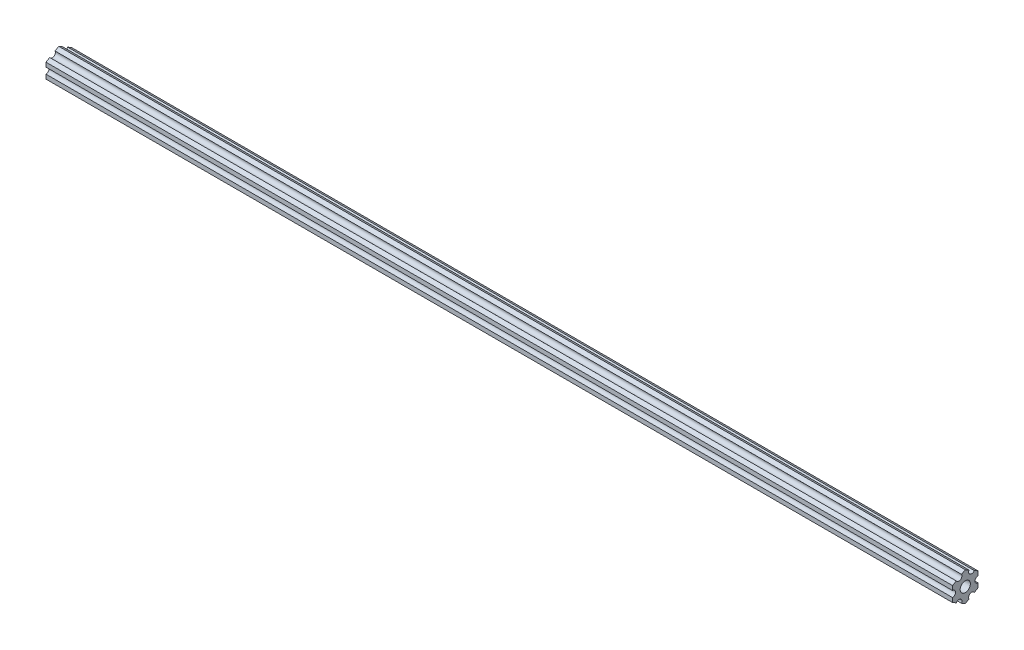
ISO-10303-21;
HEADER;
FILE_DESCRIPTION(('STEP AP214'),'2;1');
FILE_NAME('part.step','',(''),(''),'','','');
FILE_SCHEMA(('AUTOMOTIVE_DESIGN { 1 0 10303 214 1 1 1 1 }'));
ENDSEC;
DATA;
#1=APPLICATION_CONTEXT('core data for automotive mechanical design processes');
#2=APPLICATION_PROTOCOL_DEFINITION('international standard','automotive_design',2000,#1);
#3=PRODUCT_CONTEXT('',#1,'mechanical');
#4=PRODUCT('Part','Part','',(#3));
#5=PRODUCT_RELATED_PRODUCT_CATEGORY('part','',(#4));
#6=PRODUCT_DEFINITION_FORMATION('','',#4);
#7=PRODUCT_DEFINITION_CONTEXT('part definition',#1,'design');
#8=PRODUCT_DEFINITION('design','',#6,#7);
#9=PRODUCT_DEFINITION_SHAPE('','',#8);
#10=(LENGTH_UNIT() NAMED_UNIT(*) SI_UNIT(.MILLI.,.METRE.));
#11=(NAMED_UNIT(*) PLANE_ANGLE_UNIT() SI_UNIT($,.RADIAN.));
#12=(NAMED_UNIT(*) SI_UNIT($,.STERADIAN.) SOLID_ANGLE_UNIT());
#13=UNCERTAINTY_MEASURE_WITH_UNIT(LENGTH_MEASURE(1.E-05),#10,'distance_accuracy_value','');
#14=(GEOMETRIC_REPRESENTATION_CONTEXT(3) GLOBAL_UNCERTAINTY_ASSIGNED_CONTEXT((#13)) GLOBAL_UNIT_ASSIGNED_CONTEXT((#10,
#11,#12)) REPRESENTATION_CONTEXT('',''));
#15=CARTESIAN_POINT('',(0.,0.,0.));
#16=DIRECTION('',(0.,0.,1.));
#17=DIRECTION('',(1.,0.,0.));
#18=AXIS2_PLACEMENT_3D('',#15,#16,#17);
#19=CARTESIAN_POINT('',(226.06,-295.017910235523,341.513374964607));
#20=DIRECTION('',(-1.,0.,0.));
#21=DIRECTION('',(0.,0.,1.));
#22=AXIS2_PLACEMENT_3D('',#19,#20,#21);
#23=PLANE('',#22);
#24=DIRECTION('',(0.,-1.,0.));
#25=VECTOR('',#24,1.);
#26=CARTESIAN_POINT('',(226.06,-295.017910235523,335.162827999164));
#27=LINE('',#26,#25);
#28=CARTESIAN_POINT('',(226.06,-296.541910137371,335.162827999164));
#29=VERTEX_POINT('',#28);
#30=CARTESIAN_POINT('',(226.06,-298.684400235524,335.162827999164));
#31=VERTEX_POINT('',#30);
#32=EDGE_CURVE('E215',#29,#31,#27,.T.);
#33=ORIENTED_EDGE('',*,*,#32,.F.);
#34=CARTESIAN_POINT('',(226.06,-295.017910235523,335.163374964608));
#35=DIRECTION('',(-1.,0.,0.));
#36=DIRECTION('',(0.,-1.,0.));
#37=AXIS2_PLACEMENT_3D('',#34,#35,#36);
#38=CIRCLE('',#37,1.524);
#39=CARTESIAN_POINT('',(226.06,-293.493910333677,335.162827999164));
#40=VERTEX_POINT('',#39);
#41=EDGE_CURVE('E252',#29,#40,#38,.T.);
#42=ORIENTED_EDGE('',*,*,#41,.T.);
#43=DIRECTION('',(0.,-1.,0.));
#44=VECTOR('',#43,1.);
#45=CARTESIAN_POINT('',(226.06,-295.017910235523,335.162827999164));
#46=LINE('',#45,#44);
#47=CARTESIAN_POINT('',(226.06,-291.351420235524,335.162827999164));
#48=VERTEX_POINT('',#47);
#49=EDGE_CURVE('E307',#48,#40,#46,.T.);
#50=ORIENTED_EDGE('',*,*,#49,.F.);
#51=DIRECTION('',(0.,-0.5,-0.866025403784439));
#52=VECTOR('',#51,1.);
#53=CARTESIAN_POINT('',(226.06,-289.518175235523,338.338101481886));
#54=LINE('',#53,#52);
#55=CARTESIAN_POINT('',(226.06,-290.280175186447,337.018278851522));
#56=VERTEX_POINT('',#55);
#57=EDGE_CURVE('E200',#56,#48,#54,.T.);
#58=ORIENTED_EDGE('',*,*,#57,.F.);
#59=CARTESIAN_POINT('',(226.06,-289.518648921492,338.338374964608));
#60=DIRECTION('',(-1.,0.,0.));
#61=DIRECTION('',(0.,-1.,0.));
#62=AXIS2_PLACEMENT_3D('',#59,#60,#61);
#63=CIRCLE('',#62,1.524);
#64=CARTESIAN_POINT('',(226.06,-288.7561752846,339.65792411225));
#65=VERTEX_POINT('',#64);
#66=EDGE_CURVE('E203',#56,#65,#63,.T.);
#67=ORIENTED_EDGE('',*,*,#66,.T.);
#68=DIRECTION('',(0.,-0.5,-0.866025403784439));
#69=VECTOR('',#68,1.);
#70=CARTESIAN_POINT('',(226.06,-289.518175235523,338.338101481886));
#71=LINE('',#70,#69);
#72=CARTESIAN_POINT('',(226.06,-287.684930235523,341.513374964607));
#73=VERTEX_POINT('',#72);
#74=EDGE_CURVE('E321',#73,#65,#71,.T.);
#75=ORIENTED_EDGE('',*,*,#74,.F.);
#76=DIRECTION('',(0.,0.5,-0.866025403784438));
#77=VECTOR('',#76,1.);
#78=CARTESIAN_POINT('',(226.06,-289.518175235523,344.688648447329));
#79=LINE('',#78,#77);
#80=CARTESIAN_POINT('',(226.06,-288.7561752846,343.368825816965));
#81=VERTEX_POINT('',#80);
#82=EDGE_CURVE('E338',#81,#73,#79,.T.);
#83=ORIENTED_EDGE('',*,*,#82,.F.);
#84=CARTESIAN_POINT('',(226.06,-289.518648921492,344.688374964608));
#85=DIRECTION('',(-1.,0.,0.));
#86=DIRECTION('',(0.,-1.,0.));
#87=AXIS2_PLACEMENT_3D('',#84,#85,#86);
#88=CIRCLE('',#87,1.524);
#89=CARTESIAN_POINT('',(226.06,-290.280175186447,346.008471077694));
#90=VERTEX_POINT('',#89);
#91=EDGE_CURVE('E11',#81,#90,#88,.T.);
#92=ORIENTED_EDGE('',*,*,#91,.T.);
#93=DIRECTION('',(0.,0.5,-0.866025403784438));
#94=VECTOR('',#93,1.);
#95=CARTESIAN_POINT('',(226.06,-289.518175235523,344.688648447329));
#96=LINE('',#95,#94);
#97=CARTESIAN_POINT('',(226.06,-291.351420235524,347.863921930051));
#98=VERTEX_POINT('',#97);
#99=EDGE_CURVE('E360',#98,#90,#96,.T.);
#100=ORIENTED_EDGE('',*,*,#99,.F.);
#101=DIRECTION('',(0.,1.,0.));
#102=VECTOR('',#101,1.);
#103=CARTESIAN_POINT('',(226.06,-295.017910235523,347.863921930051));
#104=LINE('',#103,#102);
#105=CARTESIAN_POINT('',(226.06,-293.493910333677,347.863921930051));
#106=VERTEX_POINT('',#105);
#107=EDGE_CURVE('E219',#106,#98,#104,.T.);
#108=ORIENTED_EDGE('',*,*,#107,.F.);
#109=CARTESIAN_POINT('',(226.06,-295.017910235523,347.863374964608));
#110=DIRECTION('',(-1.,0.,0.));
#111=DIRECTION('',(0.,-1.,0.));
#112=AXIS2_PLACEMENT_3D('',#109,#110,#111);
#113=CIRCLE('',#112,1.524);
#114=CARTESIAN_POINT('',(226.06,-296.541910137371,347.863921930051));
#115=VERTEX_POINT('',#114);
#116=EDGE_CURVE('E26',#106,#115,#113,.T.);
#117=ORIENTED_EDGE('',*,*,#116,.T.);
#118=DIRECTION('',(0.,1.,0.));
#119=VECTOR('',#118,1.);
#120=CARTESIAN_POINT('',(226.06,-295.017910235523,347.863921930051));
#121=LINE('',#120,#119);
#122=CARTESIAN_POINT('',(226.06,-298.684400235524,347.863921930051));
#123=VERTEX_POINT('',#122);
#124=EDGE_CURVE('E276',#123,#115,#121,.T.);
#125=ORIENTED_EDGE('',*,*,#124,.F.);
#126=DIRECTION('',(0.,0.5,0.866025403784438));
#127=VECTOR('',#126,1.);
#128=CARTESIAN_POINT('',(226.06,-300.517645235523,344.688648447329));
#129=LINE('',#128,#127);
#130=CARTESIAN_POINT('',(226.06,-299.7556452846,346.008471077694));
#131=VERTEX_POINT('',#130);
#132=EDGE_CURVE('E221',#131,#123,#129,.T.);
#133=ORIENTED_EDGE('',*,*,#132,.F.);
#134=CARTESIAN_POINT('',(226.06,-300.517171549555,344.688374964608));
#135=DIRECTION('',(-1.,0.,0.));
#136=DIRECTION('',(0.,-1.,0.));
#137=AXIS2_PLACEMENT_3D('',#134,#135,#136);
#138=CIRCLE('',#137,1.524);
#139=CARTESIAN_POINT('',(226.06,-301.279645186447,343.368825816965));
#140=VERTEX_POINT('',#139);
#141=EDGE_CURVE('E257',#131,#140,#138,.T.);
#142=ORIENTED_EDGE('',*,*,#141,.T.);
#143=DIRECTION('',(0.,0.5,0.866025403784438));
#144=VECTOR('',#143,1.);
#145=CARTESIAN_POINT('',(226.06,-300.517645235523,344.688648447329));
#146=LINE('',#145,#144);
#147=CARTESIAN_POINT('',(226.06,-302.350890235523,341.513374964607));
#148=VERTEX_POINT('',#147);
#149=EDGE_CURVE('E287',#148,#140,#146,.T.);
#150=ORIENTED_EDGE('',*,*,#149,.F.);
#151=DIRECTION('',(0.,-0.5,0.866025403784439));
#152=VECTOR('',#151,1.);
#153=CARTESIAN_POINT('',(226.06,-300.517645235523,338.338101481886));
#154=LINE('',#153,#152);
#155=CARTESIAN_POINT('',(226.06,-301.279645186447,339.65792411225));
#156=VERTEX_POINT('',#155);
#157=EDGE_CURVE('E225',#156,#148,#154,.T.);
#158=ORIENTED_EDGE('',*,*,#157,.F.);
#159=CARTESIAN_POINT('',(226.06,-300.517171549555,338.338374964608));
#160=DIRECTION('',(-1.,0.,0.));
#161=DIRECTION('',(0.,-1.,0.));
#162=AXIS2_PLACEMENT_3D('',#159,#160,#161);
#163=CIRCLE('',#162,1.524);
#164=CARTESIAN_POINT('',(226.06,-299.7556452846,337.018278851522));
#165=VERTEX_POINT('',#164);
#166=EDGE_CURVE('E255',#156,#165,#163,.T.);
#167=ORIENTED_EDGE('',*,*,#166,.T.);
#168=DIRECTION('',(0.,-0.5,0.866025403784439));
#169=VECTOR('',#168,1.);
#170=CARTESIAN_POINT('',(226.06,-300.517645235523,338.338101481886));
#171=LINE('',#170,#169);
#172=EDGE_CURVE('E293',#31,#165,#171,.T.);
#173=ORIENTED_EDGE('',*,*,#172,.F.);
#174=EDGE_LOOP('',(#33,#42,#50,#58,#67,#75,#83,#92,#100,#108,#117,#125,#133,#142,#150,#158,#167,#173));
#175=FACE_BOUND('',#174,.T.);
#176=CARTESIAN_POINT('',(226.06,-295.017910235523,341.513374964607));
#177=DIRECTION('',(-1.,0.,0.));
#178=DIRECTION('',(0.,-1.,0.));
#179=AXIS2_PLACEMENT_3D('',#176,#177,#178);
#180=CIRCLE('',#179,2.5527);
#181=CARTESIAN_POINT('',(226.059999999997,-297.570610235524,341.513374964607));
#182=VERTEX_POINT('',#181);
#183=EDGE_CURVE('E36',#182,#182,#180,.T.);
#184=ORIENTED_EDGE('',*,*,#183,.T.);
#185=EDGE_LOOP('',(#184));
#186=FACE_BOUND('',#185,.T.);
#187=ADVANCED_FACE('F17',(#175,#186),#23,.F.);
#188=CARTESIAN_POINT('',(-226.060000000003,-289.518648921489,344.688374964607));
#189=DIRECTION('',(1.,0.,0.));
#190=DIRECTION('',(0.,1.,0.));
#191=AXIS2_PLACEMENT_3D('',#188,#189,#190);
#192=CYLINDRICAL_SURFACE('',#191,1.524);
#193=DIRECTION('',(1.,0.,0.));
#194=VECTOR('',#193,1.);
#195=CARTESIAN_POINT('',(-226.060000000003,-290.280175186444,346.008471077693));
#196=LINE('',#195,#194);
#197=CARTESIAN_POINT('',(-226.060000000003,-290.280175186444,346.008471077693));
#198=VERTEX_POINT('',#197);
#199=EDGE_CURVE('E377',#198,#90,#196,.T.);
#200=ORIENTED_EDGE('',*,*,#199,.T.);
#201=ORIENTED_EDGE('',*,*,#91,.F.);
#202=DIRECTION('',(-1.,0.,0.));
#203=VECTOR('',#202,1.);
#204=CARTESIAN_POINT('',(-226.060000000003,-288.756175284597,343.368825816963));
#205=LINE('',#204,#203);
#206=CARTESIAN_POINT('',(-226.060000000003,-288.756175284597,343.368825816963));
#207=VERTEX_POINT('',#206);
#208=EDGE_CURVE('E334',#81,#207,#205,.T.);
#209=ORIENTED_EDGE('',*,*,#208,.T.);
#210=CARTESIAN_POINT('',(-226.060000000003,-289.518648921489,344.688374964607));
#211=DIRECTION('',(1.,0.,0.));
#212=DIRECTION('',(0.,1.,0.));
#213=AXIS2_PLACEMENT_3D('',#210,#211,#212);
#214=CIRCLE('',#213,1.524);
#215=EDGE_CURVE('E189',#198,#207,#214,.T.);
#216=ORIENTED_EDGE('',*,*,#215,.F.);
#217=EDGE_LOOP('',(#200,#201,#209,#216));
#218=FACE_BOUND('',#217,.T.);
#219=ADVANCED_FACE('F438',(#218),#192,.F.);
#220=CARTESIAN_POINT('',(-226.060000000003,-295.01791023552,347.863374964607));
#221=DIRECTION('',(1.,0.,0.));
#222=DIRECTION('',(0.,1.,0.));
#223=AXIS2_PLACEMENT_3D('',#220,#221,#222);
#224=CYLINDRICAL_SURFACE('',#223,1.524);
#225=DIRECTION('',(1.,0.,0.));
#226=VECTOR('',#225,1.);
#227=CARTESIAN_POINT('',(-226.060000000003,-296.541910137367,347.86392193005));
#228=LINE('',#227,#226);
#229=CARTESIAN_POINT('',(-226.060000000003,-296.541910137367,347.86392193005));
#230=VERTEX_POINT('',#229);
#231=EDGE_CURVE('E367',#230,#115,#228,.T.);
#232=ORIENTED_EDGE('',*,*,#231,.T.);
#233=ORIENTED_EDGE('',*,*,#116,.F.);
#234=DIRECTION('',(-1.,0.,0.));
#235=VECTOR('',#234,1.);
#236=CARTESIAN_POINT('',(-226.060000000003,-293.493910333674,347.86392193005));
#237=LINE('',#236,#235);
#238=CARTESIAN_POINT('',(-226.060000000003,-293.493910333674,347.86392193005));
#239=VERTEX_POINT('',#238);
#240=EDGE_CURVE('E344',#106,#239,#237,.T.);
#241=ORIENTED_EDGE('',*,*,#240,.T.);
#242=CARTESIAN_POINT('',(-226.060000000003,-295.01791023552,347.863374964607));
#243=DIRECTION('',(1.,0.,0.));
#244=DIRECTION('',(0.,1.,0.));
#245=AXIS2_PLACEMENT_3D('',#242,#243,#244);
#246=CIRCLE('',#245,1.524);
#247=EDGE_CURVE('E239',#230,#239,#246,.T.);
#248=ORIENTED_EDGE('',*,*,#247,.F.);
#249=EDGE_LOOP('',(#232,#233,#241,#248));
#250=FACE_BOUND('',#249,.T.);
#251=ADVANCED_FACE('F423',(#250),#224,.F.);
#252=CARTESIAN_POINT('',(-226.060000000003,-300.517171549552,344.688374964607));
#253=DIRECTION('',(1.,0.,0.));
#254=DIRECTION('',(0.,1.,0.));
#255=AXIS2_PLACEMENT_3D('',#252,#253,#254);
#256=CYLINDRICAL_SURFACE('',#255,1.524);
#257=DIRECTION('',(1.,0.,0.));
#258=VECTOR('',#257,1.);
#259=CARTESIAN_POINT('',(-226.060000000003,-301.279645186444,343.368825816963));
#260=LINE('',#259,#258);
#261=CARTESIAN_POINT('',(-226.060000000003,-301.279645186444,343.368825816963));
#262=VERTEX_POINT('',#261);
#263=EDGE_CURVE('E278',#262,#140,#260,.T.);
#264=ORIENTED_EDGE('',*,*,#263,.T.);
#265=ORIENTED_EDGE('',*,*,#141,.F.);
#266=DIRECTION('',(-1.,0.,0.));
#267=VECTOR('',#266,1.);
#268=CARTESIAN_POINT('',(-226.060000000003,-299.755645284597,346.008471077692));
#269=LINE('',#268,#267);
#270=CARTESIAN_POINT('',(-226.060000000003,-299.755645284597,346.008471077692));
#271=VERTEX_POINT('',#270);
#272=EDGE_CURVE('E224',#131,#271,#269,.T.);
#273=ORIENTED_EDGE('',*,*,#272,.T.);
#274=CARTESIAN_POINT('',(-226.060000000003,-300.517171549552,344.688374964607));
#275=DIRECTION('',(1.,0.,0.));
#276=DIRECTION('',(0.,1.,0.));
#277=AXIS2_PLACEMENT_3D('',#274,#275,#276);
#278=CIRCLE('',#277,1.524);
#279=EDGE_CURVE('E247',#262,#271,#278,.T.);
#280=ORIENTED_EDGE('',*,*,#279,.F.);
#281=EDGE_LOOP('',(#264,#265,#273,#280));
#282=FACE_BOUND('',#281,.T.);
#283=ADVANCED_FACE('F447',(#282),#256,.F.);
#284=CARTESIAN_POINT('',(-226.060000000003,-300.517171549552,338.338374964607));
#285=DIRECTION('',(1.,0.,0.));
#286=DIRECTION('',(0.,1.,0.));
#287=AXIS2_PLACEMENT_3D('',#284,#285,#286);
#288=CYLINDRICAL_SURFACE('',#287,1.524);
#289=DIRECTION('',(1.,0.,0.));
#290=VECTOR('',#289,1.);
#291=CARTESIAN_POINT('',(-226.060000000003,-299.755645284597,337.018278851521));
#292=LINE('',#291,#290);
#293=CARTESIAN_POINT('',(-226.060000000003,-299.755645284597,337.018278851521));
#294=VERTEX_POINT('',#293);
#295=EDGE_CURVE('E288',#294,#165,#292,.T.);
#296=ORIENTED_EDGE('',*,*,#295,.T.);
#297=ORIENTED_EDGE('',*,*,#166,.F.);
#298=DIRECTION('',(-1.,0.,0.));
#299=VECTOR('',#298,1.);
#300=CARTESIAN_POINT('',(-226.060000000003,-301.279645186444,339.657924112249));
#301=LINE('',#300,#299);
#302=CARTESIAN_POINT('',(-226.060000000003,-301.279645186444,339.657924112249));
#303=VERTEX_POINT('',#302);
#304=EDGE_CURVE('E229',#156,#303,#301,.T.);
#305=ORIENTED_EDGE('',*,*,#304,.T.);
#306=CARTESIAN_POINT('',(-226.060000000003,-300.517171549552,338.338374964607));
#307=DIRECTION('',(1.,0.,0.));
#308=DIRECTION('',(0.,1.,0.));
#309=AXIS2_PLACEMENT_3D('',#306,#307,#308);
#310=CIRCLE('',#309,1.524);
#311=EDGE_CURVE('E244',#294,#303,#310,.T.);
#312=ORIENTED_EDGE('',*,*,#311,.F.);
#313=EDGE_LOOP('',(#296,#297,#305,#312));
#314=FACE_BOUND('',#313,.T.);
#315=ADVANCED_FACE('F456',(#314),#288,.F.);
#316=CARTESIAN_POINT('',(-226.060000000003,-295.01791023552,335.163374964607));
#317=DIRECTION('',(1.,0.,0.));
#318=DIRECTION('',(0.,1.,0.));
#319=AXIS2_PLACEMENT_3D('',#316,#317,#318);
#320=CYLINDRICAL_SURFACE('',#319,1.524);
#321=DIRECTION('',(1.,0.,0.));
#322=VECTOR('',#321,1.);
#323=CARTESIAN_POINT('',(-226.060000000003,-293.493910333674,335.162827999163));
#324=LINE('',#323,#322);
#325=CARTESIAN_POINT('',(-226.060000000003,-293.493910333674,335.162827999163));
#326=VERTEX_POINT('',#325);
#327=EDGE_CURVE('E297',#326,#40,#324,.T.);
#328=ORIENTED_EDGE('',*,*,#327,.T.);
#329=ORIENTED_EDGE('',*,*,#41,.F.);
#330=DIRECTION('',(-1.,0.,0.));
#331=VECTOR('',#330,1.);
#332=CARTESIAN_POINT('',(-226.060000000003,-296.541910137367,335.162827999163));
#333=LINE('',#332,#331);
#334=CARTESIAN_POINT('',(-226.060000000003,-296.541910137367,335.162827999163));
#335=VERTEX_POINT('',#334);
#336=EDGE_CURVE('E233',#29,#335,#333,.T.);
#337=ORIENTED_EDGE('',*,*,#336,.T.);
#338=CARTESIAN_POINT('',(-226.060000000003,-295.01791023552,335.163374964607));
#339=DIRECTION('',(1.,0.,0.));
#340=DIRECTION('',(0.,1.,0.));
#341=AXIS2_PLACEMENT_3D('',#338,#339,#340);
#342=CIRCLE('',#341,1.524);
#343=EDGE_CURVE('E188',#326,#335,#342,.T.);
#344=ORIENTED_EDGE('',*,*,#343,.F.);
#345=EDGE_LOOP('',(#328,#329,#337,#344));
#346=FACE_BOUND('',#345,.T.);
#347=ADVANCED_FACE('F458',(#346),#320,.F.);
#348=CARTESIAN_POINT('',(-226.060000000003,-289.518648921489,338.338374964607));
#349=DIRECTION('',(1.,0.,0.));
#350=DIRECTION('',(0.,1.,0.));
#351=AXIS2_PLACEMENT_3D('',#348,#349,#350);
#352=CYLINDRICAL_SURFACE('',#351,1.524);
#353=DIRECTION('',(1.,0.,0.));
#354=VECTOR('',#353,1.);
#355=CARTESIAN_POINT('',(-226.060000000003,-288.756175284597,339.657924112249));
#356=LINE('',#355,#354);
#357=CARTESIAN_POINT('',(-226.060000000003,-288.756175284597,339.657924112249));
#358=VERTEX_POINT('',#357);
#359=EDGE_CURVE('E311',#358,#65,#356,.T.);
#360=ORIENTED_EDGE('',*,*,#359,.T.);
#361=ORIENTED_EDGE('',*,*,#66,.F.);
#362=DIRECTION('',(-1.,0.,0.));
#363=VECTOR('',#362,1.);
#364=CARTESIAN_POINT('',(-226.060000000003,-290.280175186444,337.018278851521));
#365=LINE('',#364,#363);
#366=CARTESIAN_POINT('',(-226.060000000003,-290.280175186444,337.018278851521));
#367=VERTEX_POINT('',#366);
#368=EDGE_CURVE('E194',#56,#367,#365,.T.);
#369=ORIENTED_EDGE('',*,*,#368,.T.);
#370=CARTESIAN_POINT('',(-226.060000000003,-289.518648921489,338.338374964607));
#371=DIRECTION('',(1.,0.,0.));
#372=DIRECTION('',(0.,1.,0.));
#373=AXIS2_PLACEMENT_3D('',#370,#371,#372);
#374=CIRCLE('',#373,1.524);
#375=EDGE_CURVE('E173',#358,#367,#374,.T.);
#376=ORIENTED_EDGE('',*,*,#375,.F.);
#377=EDGE_LOOP('',(#360,#361,#369,#376));
#378=FACE_BOUND('',#377,.T.);
#379=ADVANCED_FACE('F202',(#378),#352,.F.);
#380=CARTESIAN_POINT('',(-226.060000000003,-295.01791023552,341.513374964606));
#381=DIRECTION('',(1.,0.,0.));
#382=DIRECTION('',(0.,1.,0.));
#383=AXIS2_PLACEMENT_3D('',#380,#381,#382);
#384=CYLINDRICAL_SURFACE('',#383,2.5527);
#385=ORIENTED_EDGE('',*,*,#183,.F.);
#386=EDGE_LOOP('',(#385));
#387=FACE_BOUND('',#386,.T.);
#388=CARTESIAN_POINT('',(-226.060000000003,-295.01791023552,341.513374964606));
#389=DIRECTION('',(1.,0.,0.));
#390=DIRECTION('',(0.,1.,0.));
#391=AXIS2_PLACEMENT_3D('',#388,#389,#390);
#392=CIRCLE('',#391,2.5527);
#393=CARTESIAN_POINT('',(-226.06,-292.46521023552,341.513374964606));
#394=VERTEX_POINT('',#393);
#395=EDGE_CURVE('E199',#394,#394,#392,.T.);
#396=ORIENTED_EDGE('',*,*,#395,.F.);
#397=EDGE_LOOP('',(#396));
#398=FACE_BOUND('',#397,.T.);
#399=ADVANCED_FACE('F497',(#387,#398),#384,.F.);
#400=CARTESIAN_POINT('',(-226.060000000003,-295.01791023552,341.513374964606));
#401=DIRECTION('',(1.,0.,0.));
#402=DIRECTION('',(0.,-1.,0.));
#403=AXIS2_PLACEMENT_3D('',#400,#401,#402);
#404=PLANE('',#403);
#405=DIRECTION('',(0.,-1.,0.));
#406=VECTOR('',#405,1.);
#407=CARTESIAN_POINT('',(-226.060000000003,-295.01791023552,347.86392193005));
#408=LINE('',#407,#406);
#409=CARTESIAN_POINT('',(-226.060000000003,-298.684400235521,347.86392193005));
#410=VERTEX_POINT('',#409);
#411=EDGE_CURVE('E384',#230,#410,#408,.T.);
#412=ORIENTED_EDGE('',*,*,#411,.F.);
#413=ORIENTED_EDGE('',*,*,#247,.T.);
#414=DIRECTION('',(0.,-1.,0.));
#415=VECTOR('',#414,1.);
#416=CARTESIAN_POINT('',(-226.060000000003,-295.01791023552,347.86392193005));
#417=LINE('',#416,#415);
#418=CARTESIAN_POINT('',(-226.060000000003,-291.351420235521,347.86392193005));
#419=VERTEX_POINT('',#418);
#420=EDGE_CURVE('E327',#419,#239,#417,.T.);
#421=ORIENTED_EDGE('',*,*,#420,.F.);
#422=DIRECTION('',(0.,-0.5,0.866025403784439));
#423=VECTOR('',#422,1.);
#424=CARTESIAN_POINT('',(-226.060000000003,-289.51817523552,344.688648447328));
#425=LINE('',#424,#423);
#426=EDGE_CURVE('E371',#198,#419,#425,.T.);
#427=ORIENTED_EDGE('',*,*,#426,.F.);
#428=ORIENTED_EDGE('',*,*,#215,.T.);
#429=DIRECTION('',(0.,-0.5,0.866025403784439));
#430=VECTOR('',#429,1.);
#431=CARTESIAN_POINT('',(-226.060000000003,-289.51817523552,344.688648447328));
#432=LINE('',#431,#430);
#433=CARTESIAN_POINT('',(-226.060000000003,-287.68493023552,341.513374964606));
#434=VERTEX_POINT('',#433);
#435=EDGE_CURVE('E341',#434,#207,#432,.T.);
#436=ORIENTED_EDGE('',*,*,#435,.F.);
#437=DIRECTION('',(0.,0.5,0.866025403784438));
#438=VECTOR('',#437,1.);
#439=CARTESIAN_POINT('',(-226.060000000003,-289.51817523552,338.338101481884));
#440=LINE('',#439,#438);
#441=EDGE_CURVE('E182',#358,#434,#440,.T.);
#442=ORIENTED_EDGE('',*,*,#441,.F.);
#443=ORIENTED_EDGE('',*,*,#375,.T.);
#444=DIRECTION('',(0.,0.5,0.866025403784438));
#445=VECTOR('',#444,1.);
#446=CARTESIAN_POINT('',(-226.060000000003,-289.51817523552,338.338101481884));
#447=LINE('',#446,#445);
#448=CARTESIAN_POINT('',(-226.060000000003,-291.351420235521,335.162827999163));
#449=VERTEX_POINT('',#448);
#450=EDGE_CURVE('E179',#449,#367,#447,.T.);
#451=ORIENTED_EDGE('',*,*,#450,.F.);
#452=DIRECTION('',(0.,1.,0.));
#453=VECTOR('',#452,1.);
#454=CARTESIAN_POINT('',(-226.060000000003,-295.01791023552,335.162827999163));
#455=LINE('',#454,#453);
#456=EDGE_CURVE('E302',#326,#449,#455,.T.);
#457=ORIENTED_EDGE('',*,*,#456,.F.);
#458=ORIENTED_EDGE('',*,*,#343,.T.);
#459=DIRECTION('',(0.,1.,0.));
#460=VECTOR('',#459,1.);
#461=CARTESIAN_POINT('',(-226.060000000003,-295.01791023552,335.162827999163));
#462=LINE('',#461,#460);
#463=CARTESIAN_POINT('',(-226.060000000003,-298.684400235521,335.162827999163));
#464=VERTEX_POINT('',#463);
#465=EDGE_CURVE('E206',#464,#335,#462,.T.);
#466=ORIENTED_EDGE('',*,*,#465,.F.);
#467=DIRECTION('',(0.,0.5,-0.866025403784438));
#468=VECTOR('',#467,1.);
#469=CARTESIAN_POINT('',(-226.060000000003,-300.51764523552,338.338101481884));
#470=LINE('',#469,#468);
#471=EDGE_CURVE('E292',#294,#464,#470,.T.);
#472=ORIENTED_EDGE('',*,*,#471,.F.);
#473=ORIENTED_EDGE('',*,*,#311,.T.);
#474=DIRECTION('',(0.,0.5,-0.866025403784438));
#475=VECTOR('',#474,1.);
#476=CARTESIAN_POINT('',(-226.060000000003,-300.51764523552,338.338101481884));
#477=LINE('',#476,#475);
#478=CARTESIAN_POINT('',(-226.060000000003,-302.35089023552,341.513374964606));
#479=VERTEX_POINT('',#478);
#480=EDGE_CURVE('E228',#479,#303,#477,.T.);
#481=ORIENTED_EDGE('',*,*,#480,.F.);
#482=DIRECTION('',(0.,-0.5,-0.866025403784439));
#483=VECTOR('',#482,1.);
#484=CARTESIAN_POINT('',(-226.060000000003,-300.51764523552,344.688648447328));
#485=LINE('',#484,#483);
#486=EDGE_CURVE('E282',#262,#479,#485,.T.);
#487=ORIENTED_EDGE('',*,*,#486,.F.);
#488=ORIENTED_EDGE('',*,*,#279,.T.);
#489=DIRECTION('',(0.,-0.5,-0.866025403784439));
#490=VECTOR('',#489,1.);
#491=CARTESIAN_POINT('',(-226.060000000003,-300.51764523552,344.688648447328));
#492=LINE('',#491,#490);
#493=EDGE_CURVE('E223',#410,#271,#492,.T.);
#494=ORIENTED_EDGE('',*,*,#493,.F.);
#495=EDGE_LOOP('',(#412,#413,#421,#427,#428,#436,#442,#443,#451,#457,#458,#466,#472,#473,#481,
#487,#488,#494));
#496=FACE_BOUND('',#495,.T.);
#497=ORIENTED_EDGE('',*,*,#395,.T.);
#498=EDGE_LOOP('',(#497));
#499=FACE_BOUND('',#498,.T.);
#500=ADVANCED_FACE('F176',(#496,#499),#404,.F.);
#501=CARTESIAN_POINT('',(-226.060000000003,-289.51817523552,338.338101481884));
#502=DIRECTION('',(0.,0.866025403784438,-0.5));
#503=DIRECTION('',(-1.,0.,0.));
#504=AXIS2_PLACEMENT_3D('',#501,#502,#503);
#505=PLANE('',#504);
#506=ORIENTED_EDGE('',*,*,#368,.F.);
#507=ORIENTED_EDGE('',*,*,#57,.T.);
#508=DIRECTION('',(1.,0.,0.));
#509=VECTOR('',#508,1.);
#510=CARTESIAN_POINT('',(-226.060000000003,-291.351420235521,335.162827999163));
#511=LINE('',#510,#509);
#512=EDGE_CURVE('E196',#449,#48,#511,.T.);
#513=ORIENTED_EDGE('',*,*,#512,.F.);
#514=ORIENTED_EDGE('',*,*,#450,.T.);
#515=EDGE_LOOP('',(#506,#507,#513,#514));
#516=FACE_BOUND('',#515,.T.);
#517=ADVANCED_FACE('F193',(#516),#505,.T.);
#518=CARTESIAN_POINT('',(-226.060000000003,-295.01791023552,335.162827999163));
#519=DIRECTION('',(0.,0.,-1.));
#520=DIRECTION('',(0.,-1.,0.));
#521=AXIS2_PLACEMENT_3D('',#518,#519,#520);
#522=PLANE('',#521);
#523=ORIENTED_EDGE('',*,*,#336,.F.);
#524=ORIENTED_EDGE('',*,*,#32,.T.);
#525=DIRECTION('',(1.,0.,0.));
#526=VECTOR('',#525,1.);
#527=CARTESIAN_POINT('',(-226.060000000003,-298.684400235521,335.162827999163));
#528=LINE('',#527,#526);
#529=EDGE_CURVE('E298',#464,#31,#528,.T.);
#530=ORIENTED_EDGE('',*,*,#529,.F.);
#531=ORIENTED_EDGE('',*,*,#465,.T.);
#532=EDGE_LOOP('',(#523,#524,#530,#531));
#533=FACE_BOUND('',#532,.T.);
#534=ADVANCED_FACE('F398',(#533),#522,.T.);
#535=CARTESIAN_POINT('',(-226.060000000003,-300.51764523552,338.338101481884));
#536=DIRECTION('',(0.,-0.866025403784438,-0.5));
#537=DIRECTION('',(0.,0.5,-0.866025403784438));
#538=AXIS2_PLACEMENT_3D('',#535,#536,#537);
#539=PLANE('',#538);
#540=ORIENTED_EDGE('',*,*,#304,.F.);
#541=ORIENTED_EDGE('',*,*,#157,.T.);
#542=DIRECTION('',(1.,0.,0.));
#543=VECTOR('',#542,1.);
#544=CARTESIAN_POINT('',(-226.060000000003,-302.35089023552,341.513374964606));
#545=LINE('',#544,#543);
#546=EDGE_CURVE('E283',#479,#148,#545,.T.);
#547=ORIENTED_EDGE('',*,*,#546,.F.);
#548=ORIENTED_EDGE('',*,*,#480,.T.);
#549=EDGE_LOOP('',(#540,#541,#547,#548));
#550=FACE_BOUND('',#549,.T.);
#551=ADVANCED_FACE('F454',(#550),#539,.T.);
#552=CARTESIAN_POINT('',(-226.060000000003,-300.51764523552,344.688648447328));
#553=DIRECTION('',(0.,-0.866025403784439,0.5));
#554=DIRECTION('',(-1.,0.,0.));
#555=AXIS2_PLACEMENT_3D('',#552,#553,#554);
#556=PLANE('',#555);
#557=ORIENTED_EDGE('',*,*,#272,.F.);
#558=ORIENTED_EDGE('',*,*,#132,.T.);
#559=DIRECTION('',(1.,0.,0.));
#560=VECTOR('',#559,1.);
#561=CARTESIAN_POINT('',(-226.060000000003,-298.684400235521,347.86392193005));
#562=LINE('',#561,#560);
#563=EDGE_CURVE('E274',#410,#123,#562,.T.);
#564=ORIENTED_EDGE('',*,*,#563,.F.);
#565=ORIENTED_EDGE('',*,*,#493,.T.);
#566=EDGE_LOOP('',(#557,#558,#564,#565));
#567=FACE_BOUND('',#566,.T.);
#568=ADVANCED_FACE('F444',(#567),#556,.T.);
#569=CARTESIAN_POINT('',(-226.060000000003,-295.01791023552,347.86392193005));
#570=DIRECTION('',(0.,0.,1.));
#571=DIRECTION('',(1.,0.,0.));
#572=AXIS2_PLACEMENT_3D('',#569,#570,#571);
#573=PLANE('',#572);
#574=ORIENTED_EDGE('',*,*,#240,.F.);
#575=ORIENTED_EDGE('',*,*,#107,.T.);
#576=DIRECTION('',(1.,0.,0.));
#577=VECTOR('',#576,1.);
#578=CARTESIAN_POINT('',(-226.060000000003,-291.351420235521,347.86392193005));
#579=LINE('',#578,#577);
#580=EDGE_CURVE('E357',#419,#98,#579,.T.);
#581=ORIENTED_EDGE('',*,*,#580,.F.);
#582=ORIENTED_EDGE('',*,*,#420,.T.);
#583=EDGE_LOOP('',(#574,#575,#581,#582));
#584=FACE_BOUND('',#583,.T.);
#585=ADVANCED_FACE('F355',(#584),#573,.T.);
#586=CARTESIAN_POINT('',(-226.060000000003,-289.51817523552,344.688648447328));
#587=DIRECTION('',(0.,0.866025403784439,0.5));
#588=DIRECTION('',(1.,0.,0.));
#589=AXIS2_PLACEMENT_3D('',#586,#587,#588);
#590=PLANE('',#589);
#591=ORIENTED_EDGE('',*,*,#208,.F.);
#592=ORIENTED_EDGE('',*,*,#82,.T.);
#593=DIRECTION('',(1.,0.,0.));
#594=VECTOR('',#593,1.);
#595=CARTESIAN_POINT('',(-226.060000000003,-287.68493023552,341.513374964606));
#596=LINE('',#595,#594);
#597=EDGE_CURVE('E317',#434,#73,#596,.T.);
#598=ORIENTED_EDGE('',*,*,#597,.F.);
#599=ORIENTED_EDGE('',*,*,#435,.T.);
#600=EDGE_LOOP('',(#591,#592,#598,#599));
#601=FACE_BOUND('',#600,.T.);
#602=ADVANCED_FACE('F473',(#601),#590,.T.);
#603=CARTESIAN_POINT('',(-226.060000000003,-289.51817523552,338.338101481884));
#604=DIRECTION('',(0.,0.866025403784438,-0.5));
#605=DIRECTION('',(-1.,0.,0.));
#606=AXIS2_PLACEMENT_3D('',#603,#604,#605);
#607=PLANE('',#606);
#608=ORIENTED_EDGE('',*,*,#359,.F.);
#609=ORIENTED_EDGE('',*,*,#441,.T.);
#610=ORIENTED_EDGE('',*,*,#597,.T.);
#611=ORIENTED_EDGE('',*,*,#74,.T.);
#612=EDGE_LOOP('',(#608,#609,#610,#611));
#613=FACE_BOUND('',#612,.T.);
#614=ADVANCED_FACE('F464',(#613),#607,.T.);
#615=CARTESIAN_POINT('',(-226.060000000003,-295.01791023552,335.162827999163));
#616=DIRECTION('',(0.,0.,-1.));
#617=DIRECTION('',(0.,-1.,0.));
#618=AXIS2_PLACEMENT_3D('',#615,#616,#617);
#619=PLANE('',#618);
#620=ORIENTED_EDGE('',*,*,#327,.F.);
#621=ORIENTED_EDGE('',*,*,#456,.T.);
#622=ORIENTED_EDGE('',*,*,#512,.T.);
#623=ORIENTED_EDGE('',*,*,#49,.T.);
#624=EDGE_LOOP('',(#620,#621,#622,#623));
#625=FACE_BOUND('',#624,.T.);
#626=ADVANCED_FACE('F462',(#625),#619,.T.);
#627=CARTESIAN_POINT('',(-226.060000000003,-300.51764523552,338.338101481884));
#628=DIRECTION('',(0.,-0.866025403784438,-0.5));
#629=DIRECTION('',(0.,0.5,-0.866025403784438));
#630=AXIS2_PLACEMENT_3D('',#627,#628,#629);
#631=PLANE('',#630);
#632=ORIENTED_EDGE('',*,*,#295,.F.);
#633=ORIENTED_EDGE('',*,*,#471,.T.);
#634=ORIENTED_EDGE('',*,*,#529,.T.);
#635=ORIENTED_EDGE('',*,*,#172,.T.);
#636=EDGE_LOOP('',(#632,#633,#634,#635));
#637=FACE_BOUND('',#636,.T.);
#638=ADVANCED_FACE('F406',(#637),#631,.T.);
#639=CARTESIAN_POINT('',(-226.060000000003,-300.51764523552,344.688648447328));
#640=DIRECTION('',(0.,-0.866025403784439,0.5));
#641=DIRECTION('',(-1.,0.,0.));
#642=AXIS2_PLACEMENT_3D('',#639,#640,#641);
#643=PLANE('',#642);
#644=ORIENTED_EDGE('',*,*,#263,.F.);
#645=ORIENTED_EDGE('',*,*,#486,.T.);
#646=ORIENTED_EDGE('',*,*,#546,.T.);
#647=ORIENTED_EDGE('',*,*,#149,.T.);
#648=EDGE_LOOP('',(#644,#645,#646,#647));
#649=FACE_BOUND('',#648,.T.);
#650=ADVANCED_FACE('F450',(#649),#643,.T.);
#651=CARTESIAN_POINT('',(-226.060000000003,-295.01791023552,347.86392193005));
#652=DIRECTION('',(0.,0.,1.));
#653=DIRECTION('',(1.,0.,0.));
#654=AXIS2_PLACEMENT_3D('',#651,#652,#653);
#655=PLANE('',#654);
#656=ORIENTED_EDGE('',*,*,#231,.F.);
#657=ORIENTED_EDGE('',*,*,#411,.T.);
#658=ORIENTED_EDGE('',*,*,#563,.T.);
#659=ORIENTED_EDGE('',*,*,#124,.T.);
#660=EDGE_LOOP('',(#656,#657,#658,#659));
#661=FACE_BOUND('',#660,.T.);
#662=ADVANCED_FACE('F425',(#661),#655,.T.);
#663=CARTESIAN_POINT('',(-226.060000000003,-289.51817523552,344.688648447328));
#664=DIRECTION('',(0.,0.866025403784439,0.5));
#665=DIRECTION('',(1.,0.,0.));
#666=AXIS2_PLACEMENT_3D('',#663,#664,#665);
#667=PLANE('',#666);
#668=ORIENTED_EDGE('',*,*,#199,.F.);
#669=ORIENTED_EDGE('',*,*,#426,.T.);
#670=ORIENTED_EDGE('',*,*,#580,.T.);
#671=ORIENTED_EDGE('',*,*,#99,.T.);
#672=EDGE_LOOP('',(#668,#669,#670,#671));
#673=FACE_BOUND('',#672,.T.);
#674=ADVANCED_FACE('F369',(#673),#667,.T.);
#675=CLOSED_SHELL('',(#187,#219,#251,#283,#315,#347,#379,#399,#500,#517,#534,#551,#568,#585,
#602,#614,#626,#638,#650,#662,#674));
#676=MANIFOLD_SOLID_BREP('B1',#675);
#677=ADVANCED_BREP_SHAPE_REPRESENTATION('',(#18,#676),#14);
#678=SHAPE_DEFINITION_REPRESENTATION(#9,#677);
ENDSEC;
END-ISO-10303-21;
